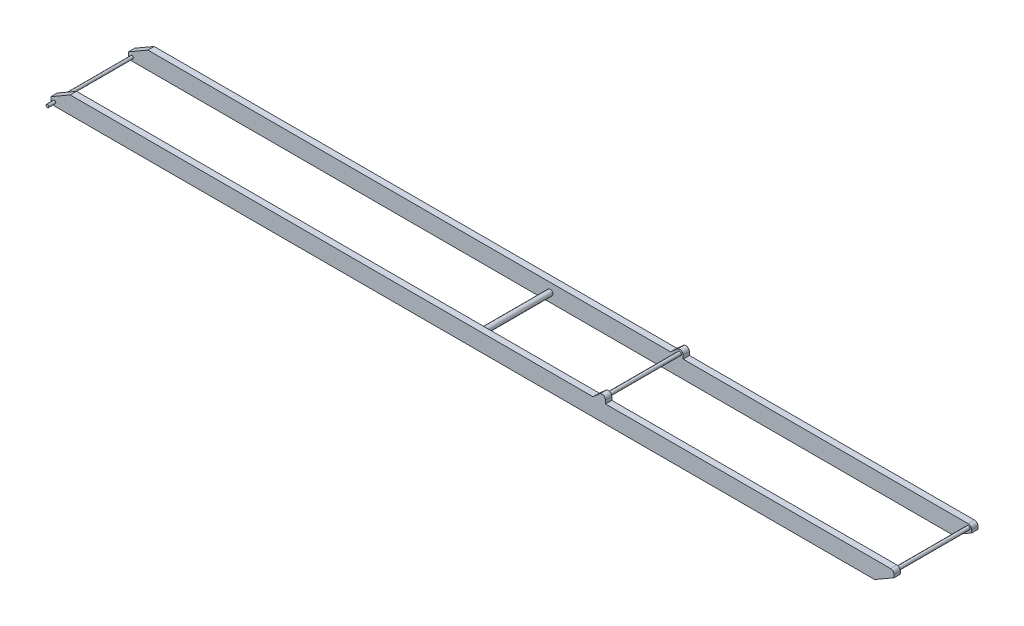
ISO-10303-21;
HEADER;
FILE_DESCRIPTION(('STEP AP214'),'2;1');
FILE_NAME('part.step','',(''),(''),'','','');
FILE_SCHEMA(('AUTOMOTIVE_DESIGN { 1 0 10303 214 1 1 1 1 }'));
ENDSEC;
DATA;
#1=APPLICATION_CONTEXT('core data for automotive mechanical design processes');
#2=APPLICATION_PROTOCOL_DEFINITION('international standard','automotive_design',2000,#1);
#3=PRODUCT_CONTEXT('',#1,'mechanical');
#4=PRODUCT('Part','Part','',(#3));
#5=PRODUCT_RELATED_PRODUCT_CATEGORY('part','',(#4));
#6=PRODUCT_DEFINITION_FORMATION('','',#4);
#7=PRODUCT_DEFINITION_CONTEXT('part definition',#1,'design');
#8=PRODUCT_DEFINITION('design','',#6,#7);
#9=PRODUCT_DEFINITION_SHAPE('','',#8);
#10=(LENGTH_UNIT() NAMED_UNIT(*) SI_UNIT(.MILLI.,.METRE.));
#11=(NAMED_UNIT(*) PLANE_ANGLE_UNIT() SI_UNIT($,.RADIAN.));
#12=(NAMED_UNIT(*) SI_UNIT($,.STERADIAN.) SOLID_ANGLE_UNIT());
#13=UNCERTAINTY_MEASURE_WITH_UNIT(LENGTH_MEASURE(1.E-05),#10,'distance_accuracy_value','');
#14=(GEOMETRIC_REPRESENTATION_CONTEXT(3) GLOBAL_UNCERTAINTY_ASSIGNED_CONTEXT((#13)) GLOBAL_UNIT_ASSIGNED_CONTEXT((#10,
#11,#12)) REPRESENTATION_CONTEXT('',''));
#15=CARTESIAN_POINT('',(0.,0.,0.));
#16=DIRECTION('',(0.,0.,1.));
#17=DIRECTION('',(1.,0.,0.));
#18=AXIS2_PLACEMENT_3D('',#15,#16,#17);
#19=CARTESIAN_POINT('',(0.,50.,600.));
#20=DIRECTION('',(0.,-1.,0.));
#21=DIRECTION('',(1.,0.,0.));
#22=AXIS2_PLACEMENT_3D('',#19,#20,#21);
#23=PLANE('',#22);
#24=DIRECTION('',(-1.,0.,0.));
#25=VECTOR('',#24,1.);
#26=CARTESIAN_POINT('',(-12390.7177934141,49.9999999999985,-510.));
#27=LINE('',#26,#25);
#28=CARTESIAN_POINT('',(-4252.24027062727,49.9999999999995,-510.));
#29=VERTEX_POINT('',#28);
#30=CARTESIAN_POINT('',(-11722.871870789,49.9999999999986,-510.));
#31=VERTEX_POINT('',#30);
#32=EDGE_CURVE('E356',#29,#31,#27,.T.);
#33=ORIENTED_EDGE('',*,*,#32,.F.);
#34=DIRECTION('',(0.,0.,-1.));
#35=VECTOR('',#34,1.);
#36=CARTESIAN_POINT('',(-4252.24027062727,49.9999999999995,11544.9951887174));
#37=LINE('',#36,#35);
#38=CARTESIAN_POINT('',(-4252.24027062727,49.9999999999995,-600.));
#39=VERTEX_POINT('',#38);
#40=EDGE_CURVE('E50',#29,#39,#37,.T.);
#41=ORIENTED_EDGE('',*,*,#40,.T.);
#42=DIRECTION('',(-1.,0.,0.));
#43=VECTOR('',#42,1.);
#44=CARTESIAN_POINT('',(0.,50.,-600.));
#45=LINE('',#44,#43);
#46=CARTESIAN_POINT('',(-11722.871870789,49.9999999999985,-600.));
#47=VERTEX_POINT('',#46);
#48=EDGE_CURVE('E386',#39,#47,#45,.T.);
#49=ORIENTED_EDGE('',*,*,#48,.T.);
#50=DIRECTION('',(0.,0.,-1.));
#51=VECTOR('',#50,1.);
#52=CARTESIAN_POINT('',(-11722.871870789,49.9999999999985,600.));
#53=LINE('',#52,#51);
#54=EDGE_CURVE('E382',#31,#47,#53,.T.);
#55=ORIENTED_EDGE('',*,*,#54,.F.);
#56=EDGE_LOOP('',(#33,#41,#49,#55));
#57=FACE_BOUND('',#56,.T.);
#58=ADVANCED_FACE('F35',(#57),#23,.F.);
#59=CARTESIAN_POINT('',(-4123.85935744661,97.,599.999999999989));
#60=DIRECTION('',(0.,0.,-1.));
#61=DIRECTION('',(-1.,0.,0.));
#62=AXIS2_PLACEMENT_3D('',#59,#60,#61);
#63=CYLINDRICAL_SURFACE('',#62,25.0000000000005);
#64=CARTESIAN_POINT('',(-4123.85935744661,97.,510.));
#65=DIRECTION('',(0.,0.,1.));
#66=DIRECTION('',(1.,0.,0.));
#67=AXIS2_PLACEMENT_3D('',#64,#65,#66);
#68=CIRCLE('',#67,25.0000000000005);
#69=CARTESIAN_POINT('',(-4148.85935744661,97.,510.));
#70=VERTEX_POINT('',#69);
#71=EDGE_CURVE('E43',#70,#70,#68,.F.);
#72=CARTESIAN_POINT('',(-4123.85935744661,97.,-510.));
#73=DIRECTION('',(0.,0.,-1.));
#74=DIRECTION('',(-1.,0.,0.));
#75=AXIS2_PLACEMENT_3D('',#72,#73,#74);
#76=CIRCLE('',#75,25.0000000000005);
#77=CARTESIAN_POINT('',(-4148.85935744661,97.,-510.));
#78=VERTEX_POINT('',#77);
#79=EDGE_CURVE('E11',#78,#78,#76,.T.);
#80=CARTESIAN_POINT('',(-4148.85935744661,97.,510.));
#81=CARTESIAN_POINT('',(-4148.85935744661,97.,499.375));
#82=CARTESIAN_POINT('',(-4148.85935744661,97.,488.75));
#83=CARTESIAN_POINT('',(-4148.85935744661,97.,467.5));
#84=CARTESIAN_POINT('',(-4148.85935744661,97.,456.875));
#85=CARTESIAN_POINT('',(-4148.85935744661,97.,435.625));
#86=CARTESIAN_POINT('',(-4148.85935744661,97.,425.));
#87=CARTESIAN_POINT('',(-4148.85935744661,97.,403.75));
#88=CARTESIAN_POINT('',(-4148.85935744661,97.,393.125));
#89=CARTESIAN_POINT('',(-4148.85935744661,97.,371.875));
#90=CARTESIAN_POINT('',(-4148.85935744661,97.,361.25));
#91=CARTESIAN_POINT('',(-4148.85935744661,97.,340.));
#92=CARTESIAN_POINT('',(-4148.85935744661,97.,329.375));
#93=CARTESIAN_POINT('',(-4148.85935744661,97.,308.125));
#94=CARTESIAN_POINT('',(-4148.85935744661,97.,297.5));
#95=CARTESIAN_POINT('',(-4148.85935744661,97.,276.25));
#96=CARTESIAN_POINT('',(-4148.85935744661,97.,265.625));
#97=CARTESIAN_POINT('',(-4148.85935744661,97.,244.375));
#98=CARTESIAN_POINT('',(-4148.85935744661,97.,233.75));
#99=CARTESIAN_POINT('',(-4148.85935744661,97.,212.5));
#100=CARTESIAN_POINT('',(-4148.85935744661,97.,201.875));
#101=CARTESIAN_POINT('',(-4148.85935744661,97.,180.625));
#102=CARTESIAN_POINT('',(-4148.85935744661,97.,170.));
#103=CARTESIAN_POINT('',(-4148.85935744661,97.,148.75));
#104=CARTESIAN_POINT('',(-4148.85935744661,97.,138.125));
#105=CARTESIAN_POINT('',(-4148.85935744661,97.,116.875));
#106=CARTESIAN_POINT('',(-4148.85935744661,97.,106.25));
#107=CARTESIAN_POINT('',(-4148.85935744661,97.,85.));
#108=CARTESIAN_POINT('',(-4148.85935744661,97.,74.375));
#109=CARTESIAN_POINT('',(-4148.85935744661,97.,53.1249999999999));
#110=CARTESIAN_POINT('',(-4148.85935744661,97.,42.4999999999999));
#111=CARTESIAN_POINT('',(-4148.85935744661,97.,21.2499999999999));
#112=CARTESIAN_POINT('',(-4148.85935744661,97.,10.6249999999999));
#113=CARTESIAN_POINT('',(-4148.85935744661,97.,-10.6250000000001));
#114=CARTESIAN_POINT('',(-4148.85935744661,97.,-21.2500000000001));
#115=CARTESIAN_POINT('',(-4148.85935744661,97.,-42.5000000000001));
#116=CARTESIAN_POINT('',(-4148.85935744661,97.,-53.1250000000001));
#117=CARTESIAN_POINT('',(-4148.85935744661,97.,-74.3750000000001));
#118=CARTESIAN_POINT('',(-4148.85935744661,97.,-85.0000000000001));
#119=CARTESIAN_POINT('',(-4148.85935744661,97.,-106.25));
#120=CARTESIAN_POINT('',(-4148.85935744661,97.,-116.875));
#121=CARTESIAN_POINT('',(-4148.85935744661,97.,-138.125));
#122=CARTESIAN_POINT('',(-4148.85935744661,97.,-148.75));
#123=CARTESIAN_POINT('',(-4148.85935744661,97.,-170.));
#124=CARTESIAN_POINT('',(-4148.85935744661,97.,-180.625));
#125=CARTESIAN_POINT('',(-4148.85935744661,97.,-201.875));
#126=CARTESIAN_POINT('',(-4148.85935744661,97.,-212.5));
#127=CARTESIAN_POINT('',(-4148.85935744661,97.,-233.75));
#128=CARTESIAN_POINT('',(-4148.85935744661,97.,-244.375));
#129=CARTESIAN_POINT('',(-4148.85935744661,97.,-265.625));
#130=CARTESIAN_POINT('',(-4148.85935744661,97.,-276.25));
#131=CARTESIAN_POINT('',(-4148.85935744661,97.,-297.5));
#132=CARTESIAN_POINT('',(-4148.85935744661,97.,-308.125));
#133=CARTESIAN_POINT('',(-4148.85935744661,97.,-329.375));
#134=CARTESIAN_POINT('',(-4148.85935744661,97.,-340.));
#135=CARTESIAN_POINT('',(-4148.85935744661,97.,-361.25));
#136=CARTESIAN_POINT('',(-4148.85935744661,97.,-371.875));
#137=CARTESIAN_POINT('',(-4148.85935744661,97.,-393.125));
#138=CARTESIAN_POINT('',(-4148.85935744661,97.,-403.75));
#139=CARTESIAN_POINT('',(-4148.85935744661,97.,-425.));
#140=CARTESIAN_POINT('',(-4148.85935744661,97.,-435.625));
#141=CARTESIAN_POINT('',(-4148.85935744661,97.,-456.875));
#142=CARTESIAN_POINT('',(-4148.85935744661,97.,-467.5));
#143=CARTESIAN_POINT('',(-4148.85935744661,97.,-488.75));
#144=CARTESIAN_POINT('',(-4148.85935744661,97.,-499.375));
#145=CARTESIAN_POINT('',(-4148.85935744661,97.,-510.));
#146=B_SPLINE_CURVE_WITH_KNOTS('',3,(#80,#81,#82,#83,#84,#85,#86,#87,#88,#89,#90,#91,#92,#93,
#94,#95,#96,#97,#98,#99,#100,#101,#102,#103,#104,#105,#106,#107,#108,#109,#110,#111,#112,#113,
#114,#115,#116,#117,#118,#119,#120,#121,#122,#123,#124,#125,#126,#127,#128,#129,#130,#131,#132,
#133,#134,#135,#136,#137,#138,#139,#140,#141,#142,#143,#144,#145),.UNSPECIFIED.,.F.,.F.,(4,2,2,
2,2,2,2,2,2,2,2,2,2,2,2,2,2,2,2,2,2,2,2,2,2,2,2,2,2,2,2,2,4),(0.,31.875,63.75,95.625,127.5,
159.375,191.25,223.125,255.,286.875,318.75,350.625,382.5,414.375,446.25,478.125,510.,541.875,
573.75,605.625,637.5,669.375,701.25,733.125,765.,796.875,828.75,860.625,892.5,924.375,956.25,
988.125,1020.),.UNSPECIFIED.);
#147=EDGE_CURVE('BSEAM430',#70,#78,#146,.T.);
#148=ORIENTED_EDGE('',*,*,#71,.T.);
#149=ORIENTED_EDGE('',*,*,#79,.F.);
#150=ORIENTED_EDGE('',*,*,#147,.T.);
#151=ORIENTED_EDGE('',*,*,#147,.F.);
#152=EDGE_LOOP('',(#148,#150,#149,#151));
#153=FACE_BOUND('',#152,.T.);
#154=ADVANCED_FACE('F430',(#153),#63,.T.);
#155=CARTESIAN_POINT('',(-12390.7177934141,-200.000000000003,510.));
#156=DIRECTION('',(0.,0.,1.));
#157=DIRECTION('',(1.,0.,0.));
#158=AXIS2_PLACEMENT_3D('',#155,#156,#157);
#159=PLANE('',#158);
#160=CARTESIAN_POINT('',(-5974.52927016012,-74.9999999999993,510.));
#161=DIRECTION('',(0.,0.,1.));
#162=DIRECTION('',(1.,0.,0.));
#163=AXIS2_PLACEMENT_3D('',#160,#161,#162);
#164=CIRCLE('',#163,40.0000000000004);
#165=CARTESIAN_POINT('',(-5934.52927016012,-74.9999999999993,510.));
#166=VERTEX_POINT('',#165);
#167=EDGE_CURVE('E263',#166,#166,#164,.F.);
#168=ORIENTED_EDGE('',*,*,#167,.F.);
#169=EDGE_LOOP('',(#168));
#170=FACE_BOUND('',#169,.T.);
#171=CARTESIAN_POINT('',(0.,0.,510.));
#172=DIRECTION('',(0.,0.,1.));
#173=DIRECTION('',(1.,0.,0.));
#174=AXIS2_PLACEMENT_3D('',#171,#172,#173);
#175=CIRCLE('',#174,25.);
#176=CARTESIAN_POINT('',(25.,0.,510.));
#177=VERTEX_POINT('',#176);
#178=EDGE_CURVE('E260',#177,#177,#175,.F.);
#179=ORIENTED_EDGE('',*,*,#178,.F.);
#180=EDGE_LOOP('',(#179));
#181=FACE_BOUND('',#180,.T.);
#182=CARTESIAN_POINT('',(-11949.0585403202,-150.000000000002,510.));
#183=DIRECTION('',(0.,0.,1.));
#184=DIRECTION('',(1.,0.,0.));
#185=AXIS2_PLACEMENT_3D('',#182,#183,#184);
#186=CIRCLE('',#185,19.9999999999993);
#187=CARTESIAN_POINT('',(-11929.0585403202,-150.000000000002,510.));
#188=VERTEX_POINT('',#187);
#189=EDGE_CURVE('E407',#188,#188,#186,.T.);
#190=ORIENTED_EDGE('',*,*,#189,.T.);
#191=EDGE_LOOP('',(#190));
#192=FACE_BOUND('',#191,.T.);
#193=DIRECTION('',(0.,-1.,0.));
#194=VECTOR('',#193,1.);
#195=CARTESIAN_POINT('',(-4073.85935744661,97.,510.));
#196=LINE('',#195,#194);
#197=CARTESIAN_POINT('',(-4073.85935744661,97.,510.));
#198=VERTEX_POINT('',#197);
#199=CARTESIAN_POINT('',(-4073.85935744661,49.9999999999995,510.));
#200=VERTEX_POINT('',#199);
#201=EDGE_CURVE('E58',#198,#200,#196,.T.);
#202=ORIENTED_EDGE('',*,*,#201,.T.);
#203=DIRECTION('',(1.,0.,0.));
#204=VECTOR('',#203,1.);
#205=CARTESIAN_POINT('',(-12390.7177934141,49.9999999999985,510.));
#206=LINE('',#205,#204);
#207=CARTESIAN_POINT('',(0.,50.,510.));
#208=VERTEX_POINT('',#207);
#209=EDGE_CURVE('E269',#200,#208,#206,.T.);
#210=ORIENTED_EDGE('',*,*,#209,.T.);
#211=CARTESIAN_POINT('',(0.,0.,510.));
#212=DIRECTION('',(0.,0.,1.));
#213=DIRECTION('',(1.,0.,0.));
#214=AXIS2_PLACEMENT_3D('',#211,#212,#213);
#215=CIRCLE('',#214,50.);
#216=CARTESIAN_POINT('',(50.,0.,510.));
#217=VERTEX_POINT('',#216);
#218=EDGE_CURVE('E282',#217,#208,#215,.T.);
#219=ORIENTED_EDGE('',*,*,#218,.F.);
#220=DIRECTION('',(0.,1.,0.));
#221=VECTOR('',#220,1.);
#222=CARTESIAN_POINT('',(50.,0.,510.));
#223=LINE('',#222,#221);
#224=CARTESIAN_POINT('',(50.,-40.,510.));
#225=VERTEX_POINT('',#224);
#226=EDGE_CURVE('E273',#225,#217,#223,.T.);
#227=ORIENTED_EDGE('',*,*,#226,.F.);
#228=DIRECTION('',(0.866025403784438,0.500000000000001,0.));
#229=VECTOR('',#228,1.);
#230=CARTESIAN_POINT('',(50.,-40.,510.));
#231=LINE('',#230,#229);
#232=CARTESIAN_POINT('',(-227.128129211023,-200.000000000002,510.));
#233=VERTEX_POINT('',#232);
#234=EDGE_CURVE('E279',#233,#225,#231,.T.);
#235=ORIENTED_EDGE('',*,*,#234,.F.);
#236=DIRECTION('',(1.,0.,0.));
#237=VECTOR('',#236,1.);
#238=CARTESIAN_POINT('',(-12390.7177934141,-200.000000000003,510.));
#239=LINE('',#238,#237);
#240=CARTESIAN_POINT('',(-11950.,-200.000000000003,510.));
#241=VERTEX_POINT('',#240);
#242=EDGE_CURVE('E270',#241,#233,#239,.T.);
#243=ORIENTED_EDGE('',*,*,#242,.F.);
#244=CARTESIAN_POINT('',(-11950.,-150.000000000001,510.));
#245=DIRECTION('',(0.,0.,1.));
#246=DIRECTION('',(1.,0.,0.));
#247=AXIS2_PLACEMENT_3D('',#244,#245,#246);
#248=CIRCLE('',#247,50.0000000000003);
#249=CARTESIAN_POINT('',(-12000.,-150.000000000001,510.));
#250=VERTEX_POINT('',#249);
#251=EDGE_CURVE('E285',#250,#241,#248,.T.);
#252=ORIENTED_EDGE('',*,*,#251,.F.);
#253=DIRECTION('',(0.,-1.,0.));
#254=VECTOR('',#253,1.);
#255=CARTESIAN_POINT('',(-12000.,-110.000000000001,510.));
#256=LINE('',#255,#254);
#257=CARTESIAN_POINT('',(-12000.,-110.000000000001,510.));
#258=VERTEX_POINT('',#257);
#259=EDGE_CURVE('E288',#258,#250,#256,.T.);
#260=ORIENTED_EDGE('',*,*,#259,.F.);
#261=DIRECTION('',(-0.866025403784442,-0.499999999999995,0.));
#262=VECTOR('',#261,1.);
#263=CARTESIAN_POINT('',(-12000.,-110.000000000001,510.));
#264=LINE('',#263,#262);
#265=CARTESIAN_POINT('',(-11722.871870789,49.9999999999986,510.));
#266=VERTEX_POINT('',#265);
#267=EDGE_CURVE('E291',#266,#258,#264,.T.);
#268=ORIENTED_EDGE('',*,*,#267,.F.);
#269=CARTESIAN_POINT('',(-4252.24027062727,49.9999999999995,510.));
#270=VERTEX_POINT('',#269);
#271=EDGE_CURVE('E274',#266,#270,#206,.T.);
#272=ORIENTED_EDGE('',*,*,#271,.T.);
#273=DIRECTION('',(0.748262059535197,0.663403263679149,0.));
#274=VECTOR('',#273,1.);
#275=CARTESIAN_POINT('',(-4255.62401367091,47.,510.));
#276=LINE('',#275,#274);
#277=CARTESIAN_POINT('',(-4157.02952063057,134.413102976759,510.));
#278=VERTEX_POINT('',#277);
#279=EDGE_CURVE('E241',#270,#278,#276,.T.);
#280=ORIENTED_EDGE('',*,*,#279,.T.);
#281=CARTESIAN_POINT('',(-4123.85935744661,97.,510.));
#282=DIRECTION('',(0.,0.,1.));
#283=DIRECTION('',(1.,0.,0.));
#284=AXIS2_PLACEMENT_3D('',#281,#282,#283);
#285=CIRCLE('',#284,49.9999999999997);
#286=EDGE_CURVE('E238',#278,#198,#285,.F.);
#287=ORIENTED_EDGE('',*,*,#286,.T.);
#288=EDGE_LOOP('',(#202,#210,#219,#227,#235,#243,#252,#260,#268,#272,#280,#287));
#289=FACE_BOUND('',#288,.T.);
#290=ORIENTED_EDGE('',*,*,#71,.F.);
#291=EDGE_LOOP('',(#290));
#292=FACE_BOUND('',#291,.T.);
#293=ADVANCED_FACE('F426',(#170,#181,#192,#289,#292),#159,.F.);
#294=CARTESIAN_POINT('',(0.,50.,600.));
#295=DIRECTION('',(0.,-1.,0.));
#296=DIRECTION('',(1.,0.,0.));
#297=AXIS2_PLACEMENT_3D('',#294,#295,#296);
#298=PLANE('',#297);
#299=ORIENTED_EDGE('',*,*,#209,.F.);
#300=DIRECTION('',(0.,0.,1.));
#301=VECTOR('',#300,1.);
#302=CARTESIAN_POINT('',(-4073.85935744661,49.9999999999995,600.));
#303=LINE('',#302,#301);
#304=CARTESIAN_POINT('',(-4073.85935744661,50.,600.));
#305=VERTEX_POINT('',#304);
#306=EDGE_CURVE('E257',#200,#305,#303,.T.);
#307=ORIENTED_EDGE('',*,*,#306,.T.);
#308=DIRECTION('',(-1.,0.,0.));
#309=VECTOR('',#308,1.);
#310=CARTESIAN_POINT('',(0.,50.,600.));
#311=LINE('',#310,#309);
#312=CARTESIAN_POINT('',(0.,50.,600.));
#313=VERTEX_POINT('',#312);
#314=EDGE_CURVE('E301',#313,#305,#311,.T.);
#315=ORIENTED_EDGE('',*,*,#314,.F.);
#316=DIRECTION('',(0.,0.,-1.));
#317=VECTOR('',#316,1.);
#318=CARTESIAN_POINT('',(0.,50.,600.));
#319=LINE('',#318,#317);
#320=EDGE_CURVE('E337',#313,#208,#319,.T.);
#321=ORIENTED_EDGE('',*,*,#320,.T.);
#322=EDGE_LOOP('',(#299,#307,#315,#321));
#323=FACE_BOUND('',#322,.T.);
#324=ADVANCED_FACE('F429',(#323),#298,.F.);
#325=CARTESIAN_POINT('',(-12390.7177934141,-200.000000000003,-510.));
#326=DIRECTION('',(0.,0.,-1.));
#327=DIRECTION('',(-1.,0.,0.));
#328=AXIS2_PLACEMENT_3D('',#325,#326,#327);
#329=PLANE('',#328);
#330=DIRECTION('',(0.,1.,0.));
#331=VECTOR('',#330,1.);
#332=CARTESIAN_POINT('',(-12000.,-110.000000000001,-510.));
#333=LINE('',#332,#331);
#334=CARTESIAN_POINT('',(-12000.,-150.000000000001,-510.));
#335=VERTEX_POINT('',#334);
#336=CARTESIAN_POINT('',(-12000.,-110.000000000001,-510.));
#337=VERTEX_POINT('',#336);
#338=EDGE_CURVE('E381',#335,#337,#333,.T.);
#339=ORIENTED_EDGE('',*,*,#338,.F.);
#340=CARTESIAN_POINT('',(-11950.,-150.000000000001,-510.));
#341=DIRECTION('',(0.,0.,-1.));
#342=DIRECTION('',(-1.,0.,0.));
#343=AXIS2_PLACEMENT_3D('',#340,#341,#342);
#344=CIRCLE('',#343,50.0000000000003);
#345=CARTESIAN_POINT('',(-11950.,-200.000000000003,-510.));
#346=VERTEX_POINT('',#345);
#347=EDGE_CURVE('E376',#346,#335,#344,.T.);
#348=ORIENTED_EDGE('',*,*,#347,.F.);
#349=DIRECTION('',(-1.,0.,0.));
#350=VECTOR('',#349,1.);
#351=CARTESIAN_POINT('',(-12390.7177934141,-200.000000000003,-510.));
#352=LINE('',#351,#350);
#353=CARTESIAN_POINT('',(-227.128129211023,-200.000000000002,-510.));
#354=VERTEX_POINT('',#353);
#355=EDGE_CURVE('E371',#354,#346,#352,.T.);
#356=ORIENTED_EDGE('',*,*,#355,.F.);
#357=DIRECTION('',(-0.866025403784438,-0.500000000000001,0.));
#358=VECTOR('',#357,1.);
#359=CARTESIAN_POINT('',(50.,-40.,-510.));
#360=LINE('',#359,#358);
#361=CARTESIAN_POINT('',(50.,-40.,-510.));
#362=VERTEX_POINT('',#361);
#363=EDGE_CURVE('E366',#362,#354,#360,.T.);
#364=ORIENTED_EDGE('',*,*,#363,.F.);
#365=DIRECTION('',(0.,-1.,0.));
#366=VECTOR('',#365,1.);
#367=CARTESIAN_POINT('',(50.,0.,-510.));
#368=LINE('',#367,#366);
#369=CARTESIAN_POINT('',(50.,0.,-510.));
#370=VERTEX_POINT('',#369);
#371=EDGE_CURVE('E361',#370,#362,#368,.T.);
#372=ORIENTED_EDGE('',*,*,#371,.F.);
#373=CARTESIAN_POINT('',(0.,0.,-510.));
#374=DIRECTION('',(0.,0.,-1.));
#375=DIRECTION('',(-1.,0.,0.));
#376=AXIS2_PLACEMENT_3D('',#373,#374,#375);
#377=CIRCLE('',#376,50.);
#378=CARTESIAN_POINT('',(0.,50.,-510.));
#379=VERTEX_POINT('',#378);
#380=EDGE_CURVE('E352',#379,#370,#377,.T.);
#381=ORIENTED_EDGE('',*,*,#380,.F.);
#382=CARTESIAN_POINT('',(-4073.85935744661,49.9999999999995,-510.));
#383=VERTEX_POINT('',#382);
#384=EDGE_CURVE('E404',#379,#383,#27,.T.);
#385=ORIENTED_EDGE('',*,*,#384,.T.);
#386=DIRECTION('',(0.,1.,0.));
#387=VECTOR('',#386,1.);
#388=CARTESIAN_POINT('',(-4073.85935744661,97.,-510.));
#389=LINE('',#388,#387);
#390=CARTESIAN_POINT('',(-4073.85935744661,97.,-510.));
#391=VERTEX_POINT('',#390);
#392=EDGE_CURVE('E231',#383,#391,#389,.T.);
#393=ORIENTED_EDGE('',*,*,#392,.T.);
#394=CARTESIAN_POINT('',(-4123.85935744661,97.,-510.));
#395=DIRECTION('',(0.,0.,-1.));
#396=DIRECTION('',(-1.,0.,0.));
#397=AXIS2_PLACEMENT_3D('',#394,#395,#396);
#398=CIRCLE('',#397,49.9999999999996);
#399=CARTESIAN_POINT('',(-4157.02952063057,134.413102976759,-510.));
#400=VERTEX_POINT('',#399);
#401=EDGE_CURVE('E205',#391,#400,#398,.F.);
#402=ORIENTED_EDGE('',*,*,#401,.T.);
#403=DIRECTION('',(-0.748262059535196,-0.663403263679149,0.));
#404=VECTOR('',#403,1.);
#405=CARTESIAN_POINT('',(-4252.24027062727,49.9999999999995,-510.));
#406=LINE('',#405,#404);
#407=EDGE_CURVE('E228',#400,#29,#406,.T.);
#408=ORIENTED_EDGE('',*,*,#407,.T.);
#409=ORIENTED_EDGE('',*,*,#32,.T.);
#410=DIRECTION('',(0.866025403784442,0.499999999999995,0.));
#411=VECTOR('',#410,1.);
#412=CARTESIAN_POINT('',(-12000.,-110.000000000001,-510.));
#413=LINE('',#412,#411);
#414=EDGE_CURVE('E385',#337,#31,#413,.T.);
#415=ORIENTED_EDGE('',*,*,#414,.F.);
#416=EDGE_LOOP('',(#339,#348,#356,#364,#372,#381,#385,#393,#402,#408,#409,#415));
#417=FACE_BOUND('',#416,.T.);
#418=CARTESIAN_POINT('',(-11949.0585403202,-150.000000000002,-510.));
#419=DIRECTION('',(0.,0.,-1.));
#420=DIRECTION('',(-1.,0.,0.));
#421=AXIS2_PLACEMENT_3D('',#418,#419,#420);
#422=CIRCLE('',#421,19.9999999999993);
#423=CARTESIAN_POINT('',(-11969.0585403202,-150.000000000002,-510.));
#424=VERTEX_POINT('',#423);
#425=EDGE_CURVE('E344',#424,#424,#422,.F.);
#426=ORIENTED_EDGE('',*,*,#425,.F.);
#427=EDGE_LOOP('',(#426));
#428=FACE_BOUND('',#427,.T.);
#429=CARTESIAN_POINT('',(0.,0.,-510.));
#430=DIRECTION('',(0.,0.,-1.));
#431=DIRECTION('',(-1.,0.,0.));
#432=AXIS2_PLACEMENT_3D('',#429,#430,#431);
#433=CIRCLE('',#432,25.);
#434=CARTESIAN_POINT('',(-25.,0.,-510.));
#435=VERTEX_POINT('',#434);
#436=EDGE_CURVE('E266',#435,#435,#433,.F.);
#437=ORIENTED_EDGE('',*,*,#436,.F.);
#438=EDGE_LOOP('',(#437));
#439=FACE_BOUND('',#438,.T.);
#440=CARTESIAN_POINT('',(-5974.52927016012,-74.9999999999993,-510.));
#441=DIRECTION('',(0.,0.,-1.));
#442=DIRECTION('',(-1.,0.,0.));
#443=AXIS2_PLACEMENT_3D('',#440,#441,#442);
#444=CIRCLE('',#443,40.0000000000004);
#445=CARTESIAN_POINT('',(-6014.52927016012,-74.9999999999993,-510.));
#446=VERTEX_POINT('',#445);
#447=EDGE_CURVE('E236',#446,#446,#444,.F.);
#448=ORIENTED_EDGE('',*,*,#447,.F.);
#449=EDGE_LOOP('',(#448));
#450=FACE_BOUND('',#449,.T.);
#451=ORIENTED_EDGE('',*,*,#79,.T.);
#452=EDGE_LOOP('',(#451));
#453=FACE_BOUND('',#452,.T.);
#454=ADVANCED_FACE('F443',(#417,#428,#439,#450,#453),#329,.F.);
#455=CARTESIAN_POINT('',(-11949.0585403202,-150.000000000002,700.));
#456=DIRECTION('',(0.,0.,-1.));
#457=DIRECTION('',(-1.,0.,0.));
#458=AXIS2_PLACEMENT_3D('',#455,#456,#457);
#459=CYLINDRICAL_SURFACE('',#458,19.9999999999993);
#460=ORIENTED_EDGE('',*,*,#425,.T.);
#461=EDGE_LOOP('',(#460));
#462=FACE_BOUND('',#461,.T.);
#463=ORIENTED_EDGE('',*,*,#189,.F.);
#464=EDGE_LOOP('',(#463));
#465=FACE_BOUND('',#464,.T.);
#466=ADVANCED_FACE('F445',(#462,#465),#459,.T.);
#467=CARTESIAN_POINT('',(0.,0.,600.));
#468=DIRECTION('',(0.,0.,-1.));
#469=DIRECTION('',(-1.,0.,0.));
#470=AXIS2_PLACEMENT_3D('',#467,#468,#469);
#471=CYLINDRICAL_SURFACE('',#470,50.);
#472=DIRECTION('',(0.,0.,-1.));
#473=VECTOR('',#472,1.);
#474=CARTESIAN_POINT('',(0.,50.,600.));
#475=LINE('',#474,#473);
#476=CARTESIAN_POINT('',(0.,50.,-600.));
#477=VERTEX_POINT('',#476);
#478=EDGE_CURVE('E390',#379,#477,#475,.T.);
#479=ORIENTED_EDGE('',*,*,#478,.F.);
#480=ORIENTED_EDGE('',*,*,#380,.T.);
#481=DIRECTION('',(0.,0.,-1.));
#482=VECTOR('',#481,1.);
#483=CARTESIAN_POINT('',(50.,0.,600.));
#484=LINE('',#483,#482);
#485=CARTESIAN_POINT('',(50.,0.,-600.));
#486=VERTEX_POINT('',#485);
#487=EDGE_CURVE('E391',#370,#486,#484,.T.);
#488=ORIENTED_EDGE('',*,*,#487,.T.);
#489=CARTESIAN_POINT('',(0.,0.,-600.));
#490=DIRECTION('',(0.,0.,1.));
#491=DIRECTION('',(1.,0.,0.));
#492=AXIS2_PLACEMENT_3D('',#489,#490,#491);
#493=CIRCLE('',#492,50.);
#494=EDGE_CURVE('E387',#486,#477,#493,.T.);
#495=ORIENTED_EDGE('',*,*,#494,.T.);
#496=EDGE_LOOP('',(#479,#480,#488,#495));
#497=FACE_BOUND('',#496,.T.);
#498=ADVANCED_FACE('F37',(#497),#471,.T.);
#499=CARTESIAN_POINT('',(-4073.85935744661,49.9999999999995,-600.));
#500=VERTEX_POINT('',#499);
#501=EDGE_CURVE('E383',#477,#500,#45,.T.);
#502=ORIENTED_EDGE('',*,*,#501,.T.);
#503=DIRECTION('',(0.,0.,-1.));
#504=VECTOR('',#503,1.);
#505=CARTESIAN_POINT('',(-4073.85935744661,49.9999999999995,11544.9951887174));
#506=LINE('',#505,#504);
#507=EDGE_CURVE('E207',#383,#500,#506,.T.);
#508=ORIENTED_EDGE('',*,*,#507,.F.);
#509=ORIENTED_EDGE('',*,*,#384,.F.);
#510=ORIENTED_EDGE('',*,*,#478,.T.);
#511=EDGE_LOOP('',(#502,#508,#509,#510));
#512=FACE_BOUND('',#511,.T.);
#513=ADVANCED_FACE('F464',(#512),#23,.F.);
#514=CARTESIAN_POINT('',(-12000.,-110.000000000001,600.));
#515=DIRECTION('',(0.499999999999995,-0.866025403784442,0.));
#516=DIRECTION('',(0.866025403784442,0.499999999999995,0.));
#517=AXIS2_PLACEMENT_3D('',#514,#515,#516);
#518=PLANE('',#517);
#519=DIRECTION('',(0.,0.,-1.));
#520=VECTOR('',#519,1.);
#521=CARTESIAN_POINT('',(-12000.,-110.000000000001,600.));
#522=LINE('',#521,#520);
#523=CARTESIAN_POINT('',(-12000.,-110.000000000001,-600.));
#524=VERTEX_POINT('',#523);
#525=EDGE_CURVE('E377',#337,#524,#522,.T.);
#526=ORIENTED_EDGE('',*,*,#525,.F.);
#527=ORIENTED_EDGE('',*,*,#414,.T.);
#528=ORIENTED_EDGE('',*,*,#54,.T.);
#529=DIRECTION('',(-0.866025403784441,-0.499999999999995,0.));
#530=VECTOR('',#529,1.);
#531=CARTESIAN_POINT('',(-12000.,-110.000000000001,-600.));
#532=LINE('',#531,#530);
#533=EDGE_CURVE('E378',#47,#524,#532,.T.);
#534=ORIENTED_EDGE('',*,*,#533,.T.);
#535=EDGE_LOOP('',(#526,#527,#528,#534));
#536=FACE_BOUND('',#535,.T.);
#537=ADVANCED_FACE('F470',(#536),#518,.F.);
#538=CARTESIAN_POINT('',(-12000.,-110.000000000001,600.));
#539=DIRECTION('',(1.,0.,0.));
#540=DIRECTION('',(0.,0.,-1.));
#541=AXIS2_PLACEMENT_3D('',#538,#539,#540);
#542=PLANE('',#541);
#543=DIRECTION('',(0.,0.,-1.));
#544=VECTOR('',#543,1.);
#545=CARTESIAN_POINT('',(-12000.,-150.000000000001,600.));
#546=LINE('',#545,#544);
#547=CARTESIAN_POINT('',(-12000.,-150.000000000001,-600.));
#548=VERTEX_POINT('',#547);
#549=EDGE_CURVE('E372',#335,#548,#546,.T.);
#550=ORIENTED_EDGE('',*,*,#549,.F.);
#551=ORIENTED_EDGE('',*,*,#338,.T.);
#552=ORIENTED_EDGE('',*,*,#525,.T.);
#553=DIRECTION('',(0.,-1.,0.));
#554=VECTOR('',#553,1.);
#555=CARTESIAN_POINT('',(-12000.,-110.000000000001,-600.));
#556=LINE('',#555,#554);
#557=EDGE_CURVE('E373',#524,#548,#556,.T.);
#558=ORIENTED_EDGE('',*,*,#557,.T.);
#559=EDGE_LOOP('',(#550,#551,#552,#558));
#560=FACE_BOUND('',#559,.T.);
#561=ADVANCED_FACE('F476',(#560),#542,.F.);
#562=CARTESIAN_POINT('',(-11950.,-150.000000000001,600.));
#563=DIRECTION('',(0.,0.,-1.));
#564=DIRECTION('',(-1.,0.,0.));
#565=AXIS2_PLACEMENT_3D('',#562,#563,#564);
#566=CYLINDRICAL_SURFACE('',#565,50.0000000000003);
#567=DIRECTION('',(0.,0.,-1.));
#568=VECTOR('',#567,1.);
#569=CARTESIAN_POINT('',(-11950.,-200.000000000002,600.));
#570=LINE('',#569,#568);
#571=CARTESIAN_POINT('',(-11950.,-200.000000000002,-600.));
#572=VERTEX_POINT('',#571);
#573=EDGE_CURVE('E367',#346,#572,#570,.T.);
#574=ORIENTED_EDGE('',*,*,#573,.F.);
#575=ORIENTED_EDGE('',*,*,#347,.T.);
#576=ORIENTED_EDGE('',*,*,#549,.T.);
#577=CARTESIAN_POINT('',(-11950.,-150.000000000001,-600.));
#578=DIRECTION('',(0.,0.,1.));
#579=DIRECTION('',(-1.,0.,0.));
#580=AXIS2_PLACEMENT_3D('',#577,#578,#579);
#581=CIRCLE('',#580,50.0000000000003);
#582=EDGE_CURVE('E368',#548,#572,#581,.T.);
#583=ORIENTED_EDGE('',*,*,#582,.T.);
#584=EDGE_LOOP('',(#574,#575,#576,#583));
#585=FACE_BOUND('',#584,.T.);
#586=ADVANCED_FACE('F496',(#585),#566,.T.);
#587=CARTESIAN_POINT('',(-227.128129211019,-200.,600.));
#588=DIRECTION('',(0.,1.,0.));
#589=DIRECTION('',(-1.,0.,0.));
#590=AXIS2_PLACEMENT_3D('',#587,#588,#589);
#591=PLANE('',#590);
#592=DIRECTION('',(0.,0.,-1.));
#593=VECTOR('',#592,1.);
#594=CARTESIAN_POINT('',(-227.128129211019,-200.,600.));
#595=LINE('',#594,#593);
#596=CARTESIAN_POINT('',(-227.128129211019,-200.,-600.));
#597=VERTEX_POINT('',#596);
#598=EDGE_CURVE('E362',#354,#597,#595,.T.);
#599=ORIENTED_EDGE('',*,*,#598,.F.);
#600=ORIENTED_EDGE('',*,*,#355,.T.);
#601=ORIENTED_EDGE('',*,*,#573,.T.);
#602=DIRECTION('',(1.,0.,0.));
#603=VECTOR('',#602,1.);
#604=CARTESIAN_POINT('',(-227.128129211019,-200.,-600.));
#605=LINE('',#604,#603);
#606=EDGE_CURVE('E363',#572,#597,#605,.T.);
#607=ORIENTED_EDGE('',*,*,#606,.T.);
#608=EDGE_LOOP('',(#599,#600,#601,#607));
#609=FACE_BOUND('',#608,.T.);
#610=ADVANCED_FACE('F493',(#609),#591,.F.);
#611=CARTESIAN_POINT('',(50.,-40.,600.));
#612=DIRECTION('',(-0.500000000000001,0.866025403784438,0.));
#613=DIRECTION('',(-0.866025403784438,-0.500000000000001,0.));
#614=AXIS2_PLACEMENT_3D('',#611,#612,#613);
#615=PLANE('',#614);
#616=DIRECTION('',(0.,0.,-1.));
#617=VECTOR('',#616,1.);
#618=CARTESIAN_POINT('',(50.,-40.,600.));
#619=LINE('',#618,#617);
#620=CARTESIAN_POINT('',(50.,-40.,-600.));
#621=VERTEX_POINT('',#620);
#622=EDGE_CURVE('E357',#362,#621,#619,.T.);
#623=ORIENTED_EDGE('',*,*,#622,.F.);
#624=ORIENTED_EDGE('',*,*,#363,.T.);
#625=ORIENTED_EDGE('',*,*,#598,.T.);
#626=DIRECTION('',(0.866025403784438,0.500000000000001,0.));
#627=VECTOR('',#626,1.);
#628=CARTESIAN_POINT('',(50.,-40.,-600.));
#629=LINE('',#628,#627);
#630=EDGE_CURVE('E358',#597,#621,#629,.T.);
#631=ORIENTED_EDGE('',*,*,#630,.T.);
#632=EDGE_LOOP('',(#623,#624,#625,#631));
#633=FACE_BOUND('',#632,.T.);
#634=ADVANCED_FACE('F490',(#633),#615,.F.);
#635=CARTESIAN_POINT('',(50.,0.,600.));
#636=DIRECTION('',(-1.,0.,0.));
#637=DIRECTION('',(0.,0.,1.));
#638=AXIS2_PLACEMENT_3D('',#635,#636,#637);
#639=PLANE('',#638);
#640=ORIENTED_EDGE('',*,*,#487,.F.);
#641=ORIENTED_EDGE('',*,*,#371,.T.);
#642=ORIENTED_EDGE('',*,*,#622,.T.);
#643=DIRECTION('',(0.,1.,0.));
#644=VECTOR('',#643,1.);
#645=CARTESIAN_POINT('',(50.,0.,-600.));
#646=LINE('',#645,#644);
#647=EDGE_CURVE('E353',#621,#486,#646,.T.);
#648=ORIENTED_EDGE('',*,*,#647,.T.);
#649=EDGE_LOOP('',(#640,#641,#642,#648));
#650=FACE_BOUND('',#649,.T.);
#651=ADVANCED_FACE('F484',(#650),#639,.F.);
#652=CARTESIAN_POINT('',(0.,0.,-600.));
#653=DIRECTION('',(0.,0.,1.));
#654=DIRECTION('',(1.,0.,0.));
#655=AXIS2_PLACEMENT_3D('',#652,#653,#654);
#656=PLANE('',#655);
#657=CARTESIAN_POINT('',(-11949.0585403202,-150.000000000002,-600.));
#658=DIRECTION('',(0.,0.,1.));
#659=DIRECTION('',(1.,0.,0.));
#660=AXIS2_PLACEMENT_3D('',#657,#658,#659);
#661=CIRCLE('',#660,19.9999999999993);
#662=CARTESIAN_POINT('',(-11929.0585403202,-150.000000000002,-600.));
#663=VERTEX_POINT('',#662);
#664=EDGE_CURVE('E349',#663,#663,#661,.F.);
#665=ORIENTED_EDGE('',*,*,#664,.F.);
#666=EDGE_LOOP('',(#665));
#667=FACE_BOUND('',#666,.T.);
#668=ORIENTED_EDGE('',*,*,#494,.F.);
#669=ORIENTED_EDGE('',*,*,#647,.F.);
#670=ORIENTED_EDGE('',*,*,#630,.F.);
#671=ORIENTED_EDGE('',*,*,#606,.F.);
#672=ORIENTED_EDGE('',*,*,#582,.F.);
#673=ORIENTED_EDGE('',*,*,#557,.F.);
#674=ORIENTED_EDGE('',*,*,#533,.F.);
#675=ORIENTED_EDGE('',*,*,#48,.F.);
#676=DIRECTION('',(0.748262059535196,0.663403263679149,0.));
#677=VECTOR('',#676,1.);
#678=CARTESIAN_POINT('',(-4252.24027062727,49.9999999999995,-600.));
#679=LINE('',#678,#677);
#680=CARTESIAN_POINT('',(-4157.02952063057,134.413102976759,-600.));
#681=VERTEX_POINT('',#680);
#682=EDGE_CURVE('E208',#39,#681,#679,.T.);
#683=ORIENTED_EDGE('',*,*,#682,.T.);
#684=CARTESIAN_POINT('',(-4123.85935744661,97.,-600.));
#685=DIRECTION('',(0.,0.,-1.));
#686=DIRECTION('',(-1.,0.,0.));
#687=AXIS2_PLACEMENT_3D('',#684,#685,#686);
#688=CIRCLE('',#687,49.9999999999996);
#689=CARTESIAN_POINT('',(-4073.85935744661,97.,-600.));
#690=VERTEX_POINT('',#689);
#691=EDGE_CURVE('E203',#681,#690,#688,.T.);
#692=ORIENTED_EDGE('',*,*,#691,.T.);
#693=DIRECTION('',(0.,-1.,0.));
#694=VECTOR('',#693,1.);
#695=CARTESIAN_POINT('',(-4073.85935744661,97.,-600.));
#696=LINE('',#695,#694);
#697=EDGE_CURVE('E211',#690,#500,#696,.T.);
#698=ORIENTED_EDGE('',*,*,#697,.T.);
#699=ORIENTED_EDGE('',*,*,#501,.F.);
#700=EDGE_LOOP('',(#668,#669,#670,#671,#672,#673,#674,#675,#683,#692,#698,#699));
#701=FACE_BOUND('',#700,.T.);
#702=ADVANCED_FACE('F219',(#667,#701),#656,.F.);
#703=CARTESIAN_POINT('',(-11949.0585403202,-150.000000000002,-700.));
#704=DIRECTION('',(0.,0.,1.));
#705=DIRECTION('',(1.,0.,0.));
#706=AXIS2_PLACEMENT_3D('',#703,#704,#705);
#707=CIRCLE('',#706,19.9999999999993);
#708=CARTESIAN_POINT('',(-11929.0585403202,-150.000000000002,-700.));
#709=VERTEX_POINT('',#708);
#710=EDGE_CURVE('E340',#709,#709,#707,.T.);
#711=ORIENTED_EDGE('',*,*,#710,.T.);
#712=EDGE_LOOP('',(#711));
#713=FACE_BOUND('',#712,.T.);
#714=ORIENTED_EDGE('',*,*,#664,.T.);
#715=EDGE_LOOP('',(#714));
#716=FACE_BOUND('',#715,.T.);
#717=ADVANCED_FACE('F455',(#713,#716),#459,.T.);
#718=CARTESIAN_POINT('',(-11949.0585403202,-150.000000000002,-700.));
#719=DIRECTION('',(0.,0.,1.));
#720=DIRECTION('',(1.,0.,0.));
#721=AXIS2_PLACEMENT_3D('',#718,#719,#720);
#722=PLANE('',#721);
#723=ORIENTED_EDGE('',*,*,#710,.F.);
#724=EDGE_LOOP('',(#723));
#725=FACE_BOUND('',#724,.T.);
#726=ADVANCED_FACE('F541',(#725),#722,.F.);
#727=CARTESIAN_POINT('',(50.,0.,600.));
#728=DIRECTION('',(-1.,0.,0.));
#729=DIRECTION('',(0.,0.,1.));
#730=AXIS2_PLACEMENT_3D('',#727,#728,#729);
#731=PLANE('',#730);
#732=DIRECTION('',(0.,0.,-1.));
#733=VECTOR('',#732,1.);
#734=CARTESIAN_POINT('',(50.,-40.,600.));
#735=LINE('',#734,#733);
#736=CARTESIAN_POINT('',(50.,-40.,600.));
#737=VERTEX_POINT('',#736);
#738=EDGE_CURVE('E319',#737,#225,#735,.T.);
#739=ORIENTED_EDGE('',*,*,#738,.T.);
#740=ORIENTED_EDGE('',*,*,#226,.T.);
#741=DIRECTION('',(0.,0.,-1.));
#742=VECTOR('',#741,1.);
#743=CARTESIAN_POINT('',(50.,0.,600.));
#744=LINE('',#743,#742);
#745=CARTESIAN_POINT('',(50.,0.,600.));
#746=VERTEX_POINT('',#745);
#747=EDGE_CURVE('E316',#746,#217,#744,.T.);
#748=ORIENTED_EDGE('',*,*,#747,.F.);
#749=DIRECTION('',(0.,1.,0.));
#750=VECTOR('',#749,1.);
#751=CARTESIAN_POINT('',(50.,0.,600.));
#752=LINE('',#751,#750);
#753=EDGE_CURVE('E314',#737,#746,#752,.T.);
#754=ORIENTED_EDGE('',*,*,#753,.F.);
#755=EDGE_LOOP('',(#739,#740,#748,#754));
#756=FACE_BOUND('',#755,.T.);
#757=ADVANCED_FACE('F537',(#756),#731,.F.);
#758=CARTESIAN_POINT('',(50.,-40.,600.));
#759=DIRECTION('',(-0.500000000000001,0.866025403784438,0.));
#760=DIRECTION('',(-0.866025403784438,-0.500000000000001,0.));
#761=AXIS2_PLACEMENT_3D('',#758,#759,#760);
#762=PLANE('',#761);
#763=DIRECTION('',(0.,0.,-1.));
#764=VECTOR('',#763,1.);
#765=CARTESIAN_POINT('',(-227.128129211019,-200.,600.));
#766=LINE('',#765,#764);
#767=CARTESIAN_POINT('',(-227.128129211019,-200.,600.));
#768=VERTEX_POINT('',#767);
#769=EDGE_CURVE('E322',#768,#233,#766,.T.);
#770=ORIENTED_EDGE('',*,*,#769,.T.);
#771=ORIENTED_EDGE('',*,*,#234,.T.);
#772=ORIENTED_EDGE('',*,*,#738,.F.);
#773=DIRECTION('',(0.866025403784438,0.500000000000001,0.));
#774=VECTOR('',#773,1.);
#775=CARTESIAN_POINT('',(50.,-40.,600.));
#776=LINE('',#775,#774);
#777=EDGE_CURVE('E312',#768,#737,#776,.T.);
#778=ORIENTED_EDGE('',*,*,#777,.F.);
#779=EDGE_LOOP('',(#770,#771,#772,#778));
#780=FACE_BOUND('',#779,.T.);
#781=ADVANCED_FACE('F540',(#780),#762,.F.);
#782=CARTESIAN_POINT('',(-227.128129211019,-200.,600.));
#783=DIRECTION('',(0.,1.,0.));
#784=DIRECTION('',(-1.,0.,0.));
#785=AXIS2_PLACEMENT_3D('',#782,#783,#784);
#786=PLANE('',#785);
#787=DIRECTION('',(0.,0.,-1.));
#788=VECTOR('',#787,1.);
#789=CARTESIAN_POINT('',(-11950.,-200.000000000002,600.));
#790=LINE('',#789,#788);
#791=CARTESIAN_POINT('',(-11950.,-200.000000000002,600.));
#792=VERTEX_POINT('',#791);
#793=EDGE_CURVE('E325',#792,#241,#790,.T.);
#794=ORIENTED_EDGE('',*,*,#793,.T.);
#795=ORIENTED_EDGE('',*,*,#242,.T.);
#796=ORIENTED_EDGE('',*,*,#769,.F.);
#797=DIRECTION('',(1.,0.,0.));
#798=VECTOR('',#797,1.);
#799=CARTESIAN_POINT('',(-227.128129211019,-200.,600.));
#800=LINE('',#799,#798);
#801=EDGE_CURVE('E310',#792,#768,#800,.T.);
#802=ORIENTED_EDGE('',*,*,#801,.F.);
#803=EDGE_LOOP('',(#794,#795,#796,#802));
#804=FACE_BOUND('',#803,.T.);
#805=ADVANCED_FACE('F545',(#804),#786,.F.);
#806=CARTESIAN_POINT('',(-11950.,-150.000000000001,600.));
#807=DIRECTION('',(0.,0.,-1.));
#808=DIRECTION('',(-1.,0.,0.));
#809=AXIS2_PLACEMENT_3D('',#806,#807,#808);
#810=CYLINDRICAL_SURFACE('',#809,50.0000000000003);
#811=DIRECTION('',(0.,0.,-1.));
#812=VECTOR('',#811,1.);
#813=CARTESIAN_POINT('',(-12000.,-150.000000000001,600.));
#814=LINE('',#813,#812);
#815=CARTESIAN_POINT('',(-12000.,-150.000000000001,600.));
#816=VERTEX_POINT('',#815);
#817=EDGE_CURVE('E328',#816,#250,#814,.T.);
#818=ORIENTED_EDGE('',*,*,#817,.T.);
#819=ORIENTED_EDGE('',*,*,#251,.T.);
#820=ORIENTED_EDGE('',*,*,#793,.F.);
#821=CARTESIAN_POINT('',(-11950.,-150.000000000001,600.));
#822=DIRECTION('',(0.,0.,1.));
#823=DIRECTION('',(-1.,0.,0.));
#824=AXIS2_PLACEMENT_3D('',#821,#822,#823);
#825=CIRCLE('',#824,50.0000000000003);
#826=EDGE_CURVE('E308',#816,#792,#825,.T.);
#827=ORIENTED_EDGE('',*,*,#826,.F.);
#828=EDGE_LOOP('',(#818,#819,#820,#827));
#829=FACE_BOUND('',#828,.T.);
#830=ADVANCED_FACE('F549',(#829),#810,.T.);
#831=CARTESIAN_POINT('',(-12000.,-110.000000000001,600.));
#832=DIRECTION('',(1.,0.,0.));
#833=DIRECTION('',(0.,0.,-1.));
#834=AXIS2_PLACEMENT_3D('',#831,#832,#833);
#835=PLANE('',#834);
#836=DIRECTION('',(0.,0.,-1.));
#837=VECTOR('',#836,1.);
#838=CARTESIAN_POINT('',(-12000.,-110.000000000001,600.));
#839=LINE('',#838,#837);
#840=CARTESIAN_POINT('',(-12000.,-110.000000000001,600.));
#841=VERTEX_POINT('',#840);
#842=EDGE_CURVE('E331',#841,#258,#839,.T.);
#843=ORIENTED_EDGE('',*,*,#842,.T.);
#844=ORIENTED_EDGE('',*,*,#259,.T.);
#845=ORIENTED_EDGE('',*,*,#817,.F.);
#846=DIRECTION('',(0.,-1.,0.));
#847=VECTOR('',#846,1.);
#848=CARTESIAN_POINT('',(-12000.,-110.000000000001,600.));
#849=LINE('',#848,#847);
#850=EDGE_CURVE('E306',#841,#816,#849,.T.);
#851=ORIENTED_EDGE('',*,*,#850,.F.);
#852=EDGE_LOOP('',(#843,#844,#845,#851));
#853=FACE_BOUND('',#852,.T.);
#854=ADVANCED_FACE('F553',(#853),#835,.F.);
#855=CARTESIAN_POINT('',(-12000.,-110.000000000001,600.));
#856=DIRECTION('',(0.499999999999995,-0.866025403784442,0.));
#857=DIRECTION('',(0.866025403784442,0.499999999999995,0.));
#858=AXIS2_PLACEMENT_3D('',#855,#856,#857);
#859=PLANE('',#858);
#860=DIRECTION('',(0.,0.,-1.));
#861=VECTOR('',#860,1.);
#862=CARTESIAN_POINT('',(-11722.871870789,49.9999999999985,600.));
#863=LINE('',#862,#861);
#864=CARTESIAN_POINT('',(-11722.871870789,49.9999999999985,600.));
#865=VERTEX_POINT('',#864);
#866=EDGE_CURVE('E334',#865,#266,#863,.T.);
#867=ORIENTED_EDGE('',*,*,#866,.T.);
#868=ORIENTED_EDGE('',*,*,#267,.T.);
#869=ORIENTED_EDGE('',*,*,#842,.F.);
#870=DIRECTION('',(-0.866025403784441,-0.499999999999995,0.));
#871=VECTOR('',#870,1.);
#872=CARTESIAN_POINT('',(-12000.,-110.000000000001,600.));
#873=LINE('',#872,#871);
#874=EDGE_CURVE('E304',#865,#841,#873,.T.);
#875=ORIENTED_EDGE('',*,*,#874,.F.);
#876=EDGE_LOOP('',(#867,#868,#869,#875));
#877=FACE_BOUND('',#876,.T.);
#878=ADVANCED_FACE('F557',(#877),#859,.F.);
#879=CARTESIAN_POINT('',(-4252.24027062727,50.0000000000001,600.));
#880=VERTEX_POINT('',#879);
#881=EDGE_CURVE('E300',#880,#865,#311,.T.);
#882=ORIENTED_EDGE('',*,*,#881,.F.);
#883=DIRECTION('',(0.,0.,-1.));
#884=VECTOR('',#883,1.);
#885=CARTESIAN_POINT('',(-4252.24027062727,49.9999999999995,600.));
#886=LINE('',#885,#884);
#887=EDGE_CURVE('E254',#880,#270,#886,.T.);
#888=ORIENTED_EDGE('',*,*,#887,.T.);
#889=ORIENTED_EDGE('',*,*,#271,.F.);
#890=ORIENTED_EDGE('',*,*,#866,.F.);
#891=EDGE_LOOP('',(#882,#888,#889,#890));
#892=FACE_BOUND('',#891,.T.);
#893=ADVANCED_FACE('F458',(#892),#298,.F.);
#894=CARTESIAN_POINT('',(0.,0.,600.));
#895=DIRECTION('',(0.,0.,-1.));
#896=DIRECTION('',(-1.,0.,0.));
#897=AXIS2_PLACEMENT_3D('',#894,#895,#896);
#898=CYLINDRICAL_SURFACE('',#897,50.);
#899=ORIENTED_EDGE('',*,*,#747,.T.);
#900=ORIENTED_EDGE('',*,*,#218,.T.);
#901=ORIENTED_EDGE('',*,*,#320,.F.);
#902=CARTESIAN_POINT('',(0.,0.,600.));
#903=DIRECTION('',(0.,0.,1.));
#904=DIRECTION('',(1.,0.,0.));
#905=AXIS2_PLACEMENT_3D('',#902,#903,#904);
#906=CIRCLE('',#905,50.);
#907=EDGE_CURVE('E297',#746,#313,#906,.T.);
#908=ORIENTED_EDGE('',*,*,#907,.F.);
#909=EDGE_LOOP('',(#899,#900,#901,#908));
#910=FACE_BOUND('',#909,.T.);
#911=ADVANCED_FACE('F535',(#910),#898,.T.);
#912=CARTESIAN_POINT('',(0.,0.,600.));
#913=DIRECTION('',(0.,0.,1.));
#914=DIRECTION('',(1.,0.,0.));
#915=AXIS2_PLACEMENT_3D('',#912,#913,#914);
#916=PLANE('',#915);
#917=CARTESIAN_POINT('',(-11949.0585403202,-150.000000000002,600.));
#918=DIRECTION('',(0.,0.,1.));
#919=DIRECTION('',(1.,0.,0.));
#920=AXIS2_PLACEMENT_3D('',#917,#918,#919);
#921=CIRCLE('',#920,19.9999999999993);
#922=CARTESIAN_POINT('',(-11929.0585403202,-150.000000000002,600.));
#923=VERTEX_POINT('',#922);
#924=EDGE_CURVE('E294',#923,#923,#921,.T.);
#925=ORIENTED_EDGE('',*,*,#924,.F.);
#926=EDGE_LOOP('',(#925));
#927=FACE_BOUND('',#926,.T.);
#928=ORIENTED_EDGE('',*,*,#314,.T.);
#929=DIRECTION('',(0.,1.,0.));
#930=VECTOR('',#929,1.);
#931=CARTESIAN_POINT('',(-4073.85935744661,97.,600.));
#932=LINE('',#931,#930);
#933=CARTESIAN_POINT('',(-4073.85935744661,97.,600.));
#934=VERTEX_POINT('',#933);
#935=EDGE_CURVE('E247',#305,#934,#932,.T.);
#936=ORIENTED_EDGE('',*,*,#935,.T.);
#937=CARTESIAN_POINT('',(-4123.85935744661,97.,600.));
#938=DIRECTION('',(0.,0.,1.));
#939=DIRECTION('',(1.,0.,0.));
#940=AXIS2_PLACEMENT_3D('',#937,#938,#939);
#941=CIRCLE('',#940,49.9999999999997);
#942=CARTESIAN_POINT('',(-4157.02952063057,134.41310297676,600.));
#943=VERTEX_POINT('',#942);
#944=EDGE_CURVE('E233',#934,#943,#941,.T.);
#945=ORIENTED_EDGE('',*,*,#944,.T.);
#946=DIRECTION('',(-0.748262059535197,-0.663403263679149,0.));
#947=VECTOR('',#946,1.);
#948=CARTESIAN_POINT('',(-4255.62401367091,47.,600.));
#949=LINE('',#948,#947);
#950=EDGE_CURVE('E244',#943,#880,#949,.T.);
#951=ORIENTED_EDGE('',*,*,#950,.T.);
#952=ORIENTED_EDGE('',*,*,#881,.T.);
#953=ORIENTED_EDGE('',*,*,#874,.T.);
#954=ORIENTED_EDGE('',*,*,#850,.T.);
#955=ORIENTED_EDGE('',*,*,#826,.T.);
#956=ORIENTED_EDGE('',*,*,#801,.T.);
#957=ORIENTED_EDGE('',*,*,#777,.T.);
#958=ORIENTED_EDGE('',*,*,#753,.T.);
#959=ORIENTED_EDGE('',*,*,#907,.T.);
#960=EDGE_LOOP('',(#928,#936,#945,#951,#952,#953,#954,#955,#956,#957,#958,#959));
#961=FACE_BOUND('',#960,.T.);
#962=ADVANCED_FACE('F531',(#927,#961),#916,.T.);
#963=CARTESIAN_POINT('',(-11949.0585403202,-150.000000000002,700.));
#964=DIRECTION('',(0.,0.,1.));
#965=DIRECTION('',(1.,0.,0.));
#966=AXIS2_PLACEMENT_3D('',#963,#964,#965);
#967=PLANE('',#966);
#968=CARTESIAN_POINT('',(-11949.0585403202,-150.000000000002,700.));
#969=DIRECTION('',(0.,0.,1.));
#970=DIRECTION('',(1.,0.,0.));
#971=AXIS2_PLACEMENT_3D('',#968,#969,#970);
#972=CIRCLE('',#971,19.9999999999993);
#973=CARTESIAN_POINT('',(-11929.0585403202,-150.000000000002,700.));
#974=VERTEX_POINT('',#973);
#975=EDGE_CURVE('E341',#974,#974,#972,.T.);
#976=ORIENTED_EDGE('',*,*,#975,.T.);
#977=EDGE_LOOP('',(#976));
#978=FACE_BOUND('',#977,.T.);
#979=ADVANCED_FACE('F534',(#978),#967,.T.);
#980=ORIENTED_EDGE('',*,*,#924,.T.);
#981=EDGE_LOOP('',(#980));
#982=FACE_BOUND('',#981,.T.);
#983=ORIENTED_EDGE('',*,*,#975,.F.);
#984=EDGE_LOOP('',(#983));
#985=FACE_BOUND('',#984,.T.);
#986=ADVANCED_FACE('F454',(#982,#985),#459,.T.);
#987=CARTESIAN_POINT('',(0.,0.,600.));
#988=DIRECTION('',(0.,0.,-1.));
#989=DIRECTION('',(-1.,0.,0.));
#990=AXIS2_PLACEMENT_3D('',#987,#988,#989);
#991=CYLINDRICAL_SURFACE('',#990,25.);
#992=ORIENTED_EDGE('',*,*,#178,.T.);
#993=EDGE_LOOP('',(#992));
#994=FACE_BOUND('',#993,.T.);
#995=ORIENTED_EDGE('',*,*,#436,.T.);
#996=EDGE_LOOP('',(#995));
#997=FACE_BOUND('',#996,.T.);
#998=ADVANCED_FACE('F527',(#994,#997),#991,.T.);
#999=CARTESIAN_POINT('',(-5974.52927016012,-74.9999999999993,600.));
#1000=DIRECTION('',(0.,0.,-1.));
#1001=DIRECTION('',(-1.,0.,0.));
#1002=AXIS2_PLACEMENT_3D('',#999,#1000,#1001);
#1003=CYLINDRICAL_SURFACE('',#1002,40.0000000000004);
#1004=ORIENTED_EDGE('',*,*,#167,.T.);
#1005=EDGE_LOOP('',(#1004));
#1006=FACE_BOUND('',#1005,.T.);
#1007=ORIENTED_EDGE('',*,*,#447,.T.);
#1008=EDGE_LOOP('',(#1007));
#1009=FACE_BOUND('',#1008,.T.);
#1010=ADVANCED_FACE('F423',(#1006,#1009),#1003,.T.);
#1011=CARTESIAN_POINT('',(-4073.85935744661,97.,302.543040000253));
#1012=DIRECTION('',(1.,0.,0.));
#1013=DIRECTION('',(0.,0.,-1.));
#1014=AXIS2_PLACEMENT_3D('',#1011,#1012,#1013);
#1015=PLANE('',#1014);
#1016=ORIENTED_EDGE('',*,*,#306,.F.);
#1017=ORIENTED_EDGE('',*,*,#201,.F.);
#1018=DIRECTION('',(0.,0.,1.));
#1019=VECTOR('',#1018,1.);
#1020=CARTESIAN_POINT('',(-4073.85935744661,97.,302.543040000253));
#1021=LINE('',#1020,#1019);
#1022=EDGE_CURVE('E239',#198,#934,#1021,.T.);
#1023=ORIENTED_EDGE('',*,*,#1022,.T.);
#1024=ORIENTED_EDGE('',*,*,#935,.F.);
#1025=EDGE_LOOP('',(#1016,#1017,#1023,#1024));
#1026=FACE_BOUND('',#1025,.T.);
#1027=ADVANCED_FACE('F514',(#1026),#1015,.T.);
#1028=CARTESIAN_POINT('',(-4255.62401367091,47.,302.543040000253));
#1029=DIRECTION('',(-0.663403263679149,0.748262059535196,0.));
#1030=DIRECTION('',(-0.748262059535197,-0.663403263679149,0.));
#1031=AXIS2_PLACEMENT_3D('',#1028,#1029,#1030);
#1032=PLANE('',#1031);
#1033=ORIENTED_EDGE('',*,*,#887,.F.);
#1034=ORIENTED_EDGE('',*,*,#950,.F.);
#1035=DIRECTION('',(0.,0.,1.));
#1036=VECTOR('',#1035,1.);
#1037=CARTESIAN_POINT('',(-4157.02952063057,134.41310297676,302.543040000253));
#1038=LINE('',#1037,#1036);
#1039=EDGE_CURVE('E249',#278,#943,#1038,.T.);
#1040=ORIENTED_EDGE('',*,*,#1039,.F.);
#1041=ORIENTED_EDGE('',*,*,#279,.F.);
#1042=EDGE_LOOP('',(#1033,#1034,#1040,#1041));
#1043=FACE_BOUND('',#1042,.T.);
#1044=ADVANCED_FACE('F517',(#1043),#1032,.T.);
#1045=CARTESIAN_POINT('',(-4123.85935744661,97.,302.543040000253));
#1046=DIRECTION('',(0.,0.,1.));
#1047=DIRECTION('',(1.,0.,0.));
#1048=AXIS2_PLACEMENT_3D('',#1045,#1046,#1047);
#1049=CYLINDRICAL_SURFACE('',#1048,49.9999999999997);
#1050=ORIENTED_EDGE('',*,*,#286,.F.);
#1051=ORIENTED_EDGE('',*,*,#1039,.T.);
#1052=ORIENTED_EDGE('',*,*,#944,.F.);
#1053=ORIENTED_EDGE('',*,*,#1022,.F.);
#1054=EDGE_LOOP('',(#1050,#1051,#1052,#1053));
#1055=FACE_BOUND('',#1054,.T.);
#1056=ADVANCED_FACE('F511',(#1055),#1049,.T.);
#1057=CARTESIAN_POINT('',(-4123.85935744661,97.,11544.9951887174));
#1058=DIRECTION('',(0.,0.,-1.));
#1059=DIRECTION('',(-1.,0.,0.));
#1060=AXIS2_PLACEMENT_3D('',#1057,#1058,#1059);
#1061=CYLINDRICAL_SURFACE('',#1060,49.9999999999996);
#1062=ORIENTED_EDGE('',*,*,#401,.F.);
#1063=DIRECTION('',(0.,0.,-1.));
#1064=VECTOR('',#1063,1.);
#1065=CARTESIAN_POINT('',(-4073.85935744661,97.,11544.9951887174));
#1066=LINE('',#1065,#1064);
#1067=EDGE_CURVE('E198',#391,#690,#1066,.T.);
#1068=ORIENTED_EDGE('',*,*,#1067,.T.);
#1069=ORIENTED_EDGE('',*,*,#691,.F.);
#1070=DIRECTION('',(0.,0.,-1.));
#1071=VECTOR('',#1070,1.);
#1072=CARTESIAN_POINT('',(-4157.02952063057,134.413102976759,11544.9951887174));
#1073=LINE('',#1072,#1071);
#1074=EDGE_CURVE('E226',#400,#681,#1073,.T.);
#1075=ORIENTED_EDGE('',*,*,#1074,.F.);
#1076=EDGE_LOOP('',(#1062,#1068,#1069,#1075));
#1077=FACE_BOUND('',#1076,.T.);
#1078=ADVANCED_FACE('F200',(#1077),#1061,.T.);
#1079=CARTESIAN_POINT('',(-4252.24027062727,49.9999999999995,11544.9951887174));
#1080=DIRECTION('',(-0.663403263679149,0.748262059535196,0.));
#1081=DIRECTION('',(-0.748262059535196,-0.663403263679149,0.));
#1082=AXIS2_PLACEMENT_3D('',#1079,#1080,#1081);
#1083=PLANE('',#1082);
#1084=ORIENTED_EDGE('',*,*,#407,.F.);
#1085=ORIENTED_EDGE('',*,*,#1074,.T.);
#1086=ORIENTED_EDGE('',*,*,#682,.F.);
#1087=ORIENTED_EDGE('',*,*,#40,.F.);
#1088=EDGE_LOOP('',(#1084,#1085,#1086,#1087));
#1089=FACE_BOUND('',#1088,.T.);
#1090=ADVANCED_FACE('F503',(#1089),#1083,.T.);
#1091=CARTESIAN_POINT('',(-4073.85935744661,97.,11544.9951887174));
#1092=DIRECTION('',(1.,0.,0.));
#1093=DIRECTION('',(0.,1.,0.));
#1094=AXIS2_PLACEMENT_3D('',#1091,#1092,#1093);
#1095=PLANE('',#1094);
#1096=ORIENTED_EDGE('',*,*,#392,.F.);
#1097=ORIENTED_EDGE('',*,*,#507,.T.);
#1098=ORIENTED_EDGE('',*,*,#697,.F.);
#1099=ORIENTED_EDGE('',*,*,#1067,.F.);
#1100=EDGE_LOOP('',(#1096,#1097,#1098,#1099));
#1101=FACE_BOUND('',#1100,.T.);
#1102=ADVANCED_FACE('F212',(#1101),#1095,.T.);
#1103=CLOSED_SHELL('',(#58,#154,#293,#324,#454,#466,#498,#513,#537,#561,#586,#610,#634,#651,
#702,#717,#726,#757,#781,#805,#830,#854,#878,#893,#911,#962,#979,#986,#998,#1010,#1027,#1044,
#1056,#1078,#1090,#1102));
#1104=MANIFOLD_SOLID_BREP('B2',#1103);
#1105=ADVANCED_BREP_SHAPE_REPRESENTATION('',(#18,#1104),#14);
#1106=SHAPE_DEFINITION_REPRESENTATION(#9,#1105);
ENDSEC;
END-ISO-10303-21;
